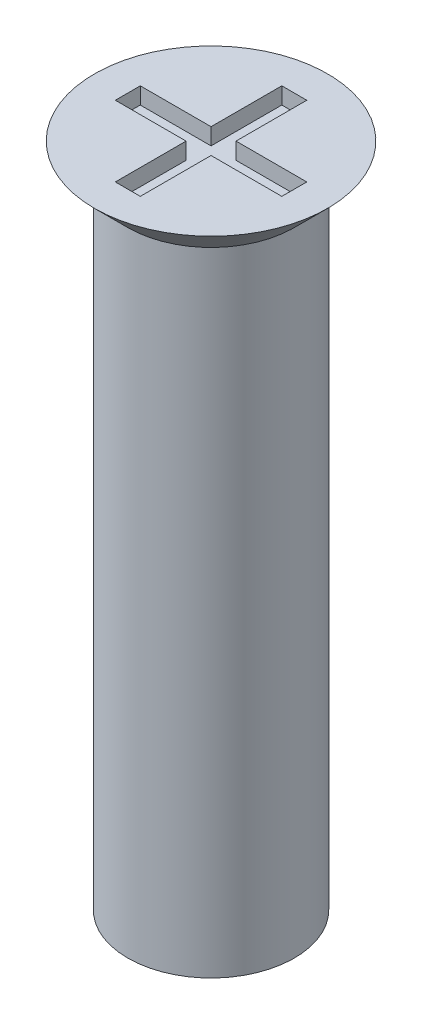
ISO-10303-21;
HEADER;
FILE_DESCRIPTION(('STEP AP214'),'2;1');
FILE_NAME('part.step','',(''),(''),'','','');
FILE_SCHEMA(('AUTOMOTIVE_DESIGN { 1 0 10303 214 1 1 1 1 }'));
ENDSEC;
DATA;
#1=APPLICATION_CONTEXT('core data for automotive mechanical design processes');
#2=APPLICATION_PROTOCOL_DEFINITION('international standard','automotive_design',2000,#1);
#3=PRODUCT_CONTEXT('',#1,'mechanical');
#4=PRODUCT('Part','Part','',(#3));
#5=PRODUCT_RELATED_PRODUCT_CATEGORY('part','',(#4));
#6=PRODUCT_DEFINITION_FORMATION('','',#4);
#7=PRODUCT_DEFINITION_CONTEXT('part definition',#1,'design');
#8=PRODUCT_DEFINITION('design','',#6,#7);
#9=PRODUCT_DEFINITION_SHAPE('','',#8);
#10=(LENGTH_UNIT() NAMED_UNIT(*) SI_UNIT(.MILLI.,.METRE.));
#11=(NAMED_UNIT(*) PLANE_ANGLE_UNIT() SI_UNIT($,.RADIAN.));
#12=(NAMED_UNIT(*) SI_UNIT($,.STERADIAN.) SOLID_ANGLE_UNIT());
#13=UNCERTAINTY_MEASURE_WITH_UNIT(LENGTH_MEASURE(1.E-05),#10,'distance_accuracy_value','');
#14=(GEOMETRIC_REPRESENTATION_CONTEXT(3) GLOBAL_UNCERTAINTY_ASSIGNED_CONTEXT((#13)) GLOBAL_UNIT_ASSIGNED_CONTEXT((#10,
#11,#12)) REPRESENTATION_CONTEXT('',''));
#15=CARTESIAN_POINT('',(0.,0.,0.));
#16=DIRECTION('',(0.,0.,1.));
#17=DIRECTION('',(1.,0.,0.));
#18=AXIS2_PLACEMENT_3D('',#15,#16,#17);
#19=CARTESIAN_POINT('',(0.,0.,0.));
#20=DIRECTION('',(0.,-1.,0.));
#21=DIRECTION('',(0.,0.,-1.));
#22=AXIS2_PLACEMENT_3D('',#19,#20,#21);
#23=PLANE('',#22);
#24=CARTESIAN_POINT('',(0.,0.,0.));
#25=DIRECTION('',(0.,1.,0.));
#26=DIRECTION('',(0.,0.,1.));
#27=AXIS2_PLACEMENT_3D('',#24,#25,#26);
#28=CIRCLE('',#27,0.5);
#29=CARTESIAN_POINT('',(0.,0.,0.5));
#30=VERTEX_POINT('',#29);
#31=EDGE_CURVE('E11',#30,#30,#28,.T.);
#32=ORIENTED_EDGE('',*,*,#31,.F.);
#33=EDGE_LOOP('',(#32));
#34=FACE_BOUND('',#33,.T.);
#35=ADVANCED_FACE('F35',(#34),#23,.T.);
#36=CARTESIAN_POINT('',(0.,2.47581230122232,0.));
#37=DIRECTION('',(0.,1.,0.));
#38=DIRECTION('',(0.,0.,1.));
#39=AXIS2_PLACEMENT_3D('',#36,#37,#38);
#40=CYLINDRICAL_SURFACE('',#39,0.5);
#41=ORIENTED_EDGE('',*,*,#31,.T.);
#42=EDGE_LOOP('',(#41));
#43=FACE_BOUND('',#42,.T.);
#44=CARTESIAN_POINT('',(0.,3.8,0.));
#45=DIRECTION('',(0.,1.,0.));
#46=DIRECTION('',(0.,0.,1.));
#47=AXIS2_PLACEMENT_3D('',#44,#45,#46);
#48=CIRCLE('',#47,0.5);
#49=CARTESIAN_POINT('',(0.,3.8,0.5));
#50=VERTEX_POINT('',#49);
#51=EDGE_CURVE('E42',#50,#50,#48,.T.);
#52=ORIENTED_EDGE('',*,*,#51,.F.);
#53=EDGE_LOOP('',(#52));
#54=FACE_BOUND('',#53,.T.);
#55=ADVANCED_FACE('F215',(#43,#54),#40,.T.);
#56=CARTESIAN_POINT('',(0.,4.,0.));
#57=DIRECTION('',(0.,1.,0.));
#58=DIRECTION('',(0.,0.,1.));
#59=AXIS2_PLACEMENT_3D('',#56,#57,#58);
#60=CONICAL_SURFACE('',#59,0.7,0.785398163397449);
#61=ORIENTED_EDGE('',*,*,#51,.T.);
#62=EDGE_LOOP('',(#61));
#63=FACE_BOUND('',#62,.T.);
#64=CARTESIAN_POINT('',(0.,4.,0.));
#65=DIRECTION('',(0.,1.,0.));
#66=DIRECTION('',(0.,0.,1.));
#67=AXIS2_PLACEMENT_3D('',#64,#65,#66);
#68=CIRCLE('',#67,0.7);
#69=CARTESIAN_POINT('',(0.,4.,0.7));
#70=VERTEX_POINT('',#69);
#71=EDGE_CURVE('E190',#70,#70,#68,.T.);
#72=ORIENTED_EDGE('',*,*,#71,.F.);
#73=EDGE_LOOP('',(#72));
#74=FACE_BOUND('',#73,.T.);
#75=ADVANCED_FACE('F212',(#63,#74),#60,.T.);
#76=CARTESIAN_POINT('',(-0.7,4.,0.));
#77=DIRECTION('',(0.,1.,0.));
#78=DIRECTION('',(0.,0.,1.));
#79=AXIS2_PLACEMENT_3D('',#76,#77,#78);
#80=PLANE('',#79);
#81=DIRECTION('',(0.,0.,1.));
#82=VECTOR('',#81,1.);
#83=CARTESIAN_POINT('',(-0.075,4.,-0.5));
#84=LINE('',#83,#82);
#85=CARTESIAN_POINT('',(-0.075,4.,-0.5));
#86=VERTEX_POINT('',#85);
#87=CARTESIAN_POINT('',(-0.075,4.,-0.075));
#88=VERTEX_POINT('',#87);
#89=EDGE_CURVE('E49',#86,#88,#84,.T.);
#90=ORIENTED_EDGE('',*,*,#89,.F.);
#91=DIRECTION('',(-1.,0.,0.));
#92=VECTOR('',#91,1.);
#93=CARTESIAN_POINT('',(-0.075,4.,-0.5));
#94=LINE('',#93,#92);
#95=CARTESIAN_POINT('',(0.075,4.,-0.5));
#96=VERTEX_POINT('',#95);
#97=EDGE_CURVE('E186',#96,#86,#94,.T.);
#98=ORIENTED_EDGE('',*,*,#97,.F.);
#99=DIRECTION('',(0.,0.,-1.));
#100=VECTOR('',#99,1.);
#101=CARTESIAN_POINT('',(0.075,4.,-0.5));
#102=LINE('',#101,#100);
#103=CARTESIAN_POINT('',(0.075,4.,-0.075));
#104=VERTEX_POINT('',#103);
#105=EDGE_CURVE('E184',#104,#96,#102,.T.);
#106=ORIENTED_EDGE('',*,*,#105,.F.);
#107=DIRECTION('',(-1.,0.,0.));
#108=VECTOR('',#107,1.);
#109=CARTESIAN_POINT('',(0.5,4.,-0.075));
#110=LINE('',#109,#108);
#111=CARTESIAN_POINT('',(0.5,4.,-0.075));
#112=VERTEX_POINT('',#111);
#113=EDGE_CURVE('E133',#112,#104,#110,.T.);
#114=ORIENTED_EDGE('',*,*,#113,.F.);
#115=DIRECTION('',(0.,0.,-1.));
#116=VECTOR('',#115,1.);
#117=CARTESIAN_POINT('',(0.5,4.,-0.075));
#118=LINE('',#117,#116);
#119=CARTESIAN_POINT('',(0.5,4.,0.075));
#120=VERTEX_POINT('',#119);
#121=EDGE_CURVE('E180',#120,#112,#118,.T.);
#122=ORIENTED_EDGE('',*,*,#121,.F.);
#123=DIRECTION('',(1.,0.,0.));
#124=VECTOR('',#123,1.);
#125=CARTESIAN_POINT('',(0.5,4.,0.075));
#126=LINE('',#125,#124);
#127=CARTESIAN_POINT('',(0.075,4.,0.075));
#128=VERTEX_POINT('',#127);
#129=EDGE_CURVE('E177',#128,#120,#126,.T.);
#130=ORIENTED_EDGE('',*,*,#129,.F.);
#131=DIRECTION('',(0.,0.,-1.));
#132=VECTOR('',#131,1.);
#133=CARTESIAN_POINT('',(0.075,4.,0.075));
#134=LINE('',#133,#132);
#135=CARTESIAN_POINT('',(0.075,4.,0.5));
#136=VERTEX_POINT('',#135);
#137=EDGE_CURVE('E174',#136,#128,#134,.T.);
#138=ORIENTED_EDGE('',*,*,#137,.F.);
#139=DIRECTION('',(1.,0.,0.));
#140=VECTOR('',#139,1.);
#141=CARTESIAN_POINT('',(-0.075,4.,0.5));
#142=LINE('',#141,#140);
#143=CARTESIAN_POINT('',(-0.075,4.,0.5));
#144=VERTEX_POINT('',#143);
#145=EDGE_CURVE('E171',#144,#136,#142,.T.);
#146=ORIENTED_EDGE('',*,*,#145,.F.);
#147=DIRECTION('',(0.,0.,1.));
#148=VECTOR('',#147,1.);
#149=CARTESIAN_POINT('',(-0.075,4.,0.075));
#150=LINE('',#149,#148);
#151=CARTESIAN_POINT('',(-0.075,4.,0.075));
#152=VERTEX_POINT('',#151);
#153=EDGE_CURVE('E168',#152,#144,#150,.T.);
#154=ORIENTED_EDGE('',*,*,#153,.F.);
#155=DIRECTION('',(1.,0.,0.));
#156=VECTOR('',#155,1.);
#157=CARTESIAN_POINT('',(-0.075,4.,0.075));
#158=LINE('',#157,#156);
#159=CARTESIAN_POINT('',(-0.5,4.,0.075));
#160=VERTEX_POINT('',#159);
#161=EDGE_CURVE('E165',#160,#152,#158,.T.);
#162=ORIENTED_EDGE('',*,*,#161,.F.);
#163=DIRECTION('',(0.,0.,1.));
#164=VECTOR('',#163,1.);
#165=CARTESIAN_POINT('',(-0.5,4.,-0.075));
#166=LINE('',#165,#164);
#167=CARTESIAN_POINT('',(-0.5,4.,-0.075));
#168=VERTEX_POINT('',#167);
#169=EDGE_CURVE('E162',#168,#160,#166,.T.);
#170=ORIENTED_EDGE('',*,*,#169,.F.);
#171=DIRECTION('',(-1.,0.,0.));
#172=VECTOR('',#171,1.);
#173=CARTESIAN_POINT('',(-0.075,4.,-0.075));
#174=LINE('',#173,#172);
#175=EDGE_CURVE('E159',#88,#168,#174,.T.);
#176=ORIENTED_EDGE('',*,*,#175,.F.);
#177=EDGE_LOOP('',(#90,#98,#106,#114,#122,#130,#138,#146,#154,#162,#170,#176));
#178=FACE_BOUND('',#177,.T.);
#179=ORIENTED_EDGE('',*,*,#71,.T.);
#180=EDGE_LOOP('',(#179));
#181=FACE_BOUND('',#180,.T.);
#182=ADVANCED_FACE('F222',(#178,#181),#80,.T.);
#183=CARTESIAN_POINT('',(-0.075,3.9,-0.5));
#184=DIRECTION('',(-1.,0.,0.));
#185=DIRECTION('',(0.,0.,1.));
#186=AXIS2_PLACEMENT_3D('',#183,#184,#185);
#187=PLANE('',#186);
#188=ORIENTED_EDGE('',*,*,#89,.T.);
#189=DIRECTION('',(0.,1.,0.));
#190=VECTOR('',#189,1.);
#191=CARTESIAN_POINT('',(-0.075,3.9,-0.075));
#192=LINE('',#191,#190);
#193=CARTESIAN_POINT('',(-0.075,3.9,-0.075));
#194=VERTEX_POINT('',#193);
#195=EDGE_CURVE('E97',#194,#88,#192,.T.);
#196=ORIENTED_EDGE('',*,*,#195,.F.);
#197=DIRECTION('',(0.,0.,1.));
#198=VECTOR('',#197,1.);
#199=CARTESIAN_POINT('',(-0.075,3.9,-0.5));
#200=LINE('',#199,#198);
#201=CARTESIAN_POINT('',(-0.075,3.9,-0.5));
#202=VERTEX_POINT('',#201);
#203=EDGE_CURVE('E188',#202,#194,#200,.T.);
#204=ORIENTED_EDGE('',*,*,#203,.F.);
#205=DIRECTION('',(0.,1.,0.));
#206=VECTOR('',#205,1.);
#207=CARTESIAN_POINT('',(-0.075,3.9,-0.5));
#208=LINE('',#207,#206);
#209=EDGE_CURVE('E57',#202,#86,#208,.T.);
#210=ORIENTED_EDGE('',*,*,#209,.T.);
#211=EDGE_LOOP('',(#188,#196,#204,#210));
#212=FACE_BOUND('',#211,.T.);
#213=ADVANCED_FACE('F228',(#212),#187,.F.);
#214=CARTESIAN_POINT('',(-0.075,3.9,-0.5));
#215=DIRECTION('',(0.,0.,-1.));
#216=DIRECTION('',(-1.,0.,0.));
#217=AXIS2_PLACEMENT_3D('',#214,#215,#216);
#218=PLANE('',#217);
#219=ORIENTED_EDGE('',*,*,#97,.T.);
#220=ORIENTED_EDGE('',*,*,#209,.F.);
#221=DIRECTION('',(-1.,0.,0.));
#222=VECTOR('',#221,1.);
#223=CARTESIAN_POINT('',(-0.075,3.9,-0.5));
#224=LINE('',#223,#222);
#225=CARTESIAN_POINT('',(0.075,3.9,-0.5));
#226=VERTEX_POINT('',#225);
#227=EDGE_CURVE('E145',#226,#202,#224,.T.);
#228=ORIENTED_EDGE('',*,*,#227,.F.);
#229=DIRECTION('',(0.,1.,0.));
#230=VECTOR('',#229,1.);
#231=CARTESIAN_POINT('',(0.075,3.9,-0.5));
#232=LINE('',#231,#230);
#233=EDGE_CURVE('E137',#226,#96,#232,.T.);
#234=ORIENTED_EDGE('',*,*,#233,.T.);
#235=EDGE_LOOP('',(#219,#220,#228,#234));
#236=FACE_BOUND('',#235,.T.);
#237=ADVANCED_FACE('F232',(#236),#218,.F.);
#238=CARTESIAN_POINT('',(0.075,3.9,-0.5));
#239=DIRECTION('',(1.,0.,0.));
#240=DIRECTION('',(0.,0.,-1.));
#241=AXIS2_PLACEMENT_3D('',#238,#239,#240);
#242=PLANE('',#241);
#243=ORIENTED_EDGE('',*,*,#105,.T.);
#244=ORIENTED_EDGE('',*,*,#233,.F.);
#245=DIRECTION('',(0.,0.,-1.));
#246=VECTOR('',#245,1.);
#247=CARTESIAN_POINT('',(0.075,3.9,-0.5));
#248=LINE('',#247,#246);
#249=CARTESIAN_POINT('',(0.075,3.9,-0.075));
#250=VERTEX_POINT('',#249);
#251=EDGE_CURVE('E141',#250,#226,#248,.T.);
#252=ORIENTED_EDGE('',*,*,#251,.F.);
#253=DIRECTION('',(0.,1.,0.));
#254=VECTOR('',#253,1.);
#255=CARTESIAN_POINT('',(0.075,3.9,-0.075));
#256=LINE('',#255,#254);
#257=EDGE_CURVE('E126',#250,#104,#256,.T.);
#258=ORIENTED_EDGE('',*,*,#257,.T.);
#259=EDGE_LOOP('',(#243,#244,#252,#258));
#260=FACE_BOUND('',#259,.T.);
#261=ADVANCED_FACE('F142',(#260),#242,.F.);
#262=CARTESIAN_POINT('',(0.5,3.9,-0.075));
#263=DIRECTION('',(0.,0.,-1.));
#264=DIRECTION('',(-1.,0.,0.));
#265=AXIS2_PLACEMENT_3D('',#262,#263,#264);
#266=PLANE('',#265);
#267=ORIENTED_EDGE('',*,*,#113,.T.);
#268=ORIENTED_EDGE('',*,*,#257,.F.);
#269=DIRECTION('',(-1.,0.,0.));
#270=VECTOR('',#269,1.);
#271=CARTESIAN_POINT('',(0.5,3.9,-0.075));
#272=LINE('',#271,#270);
#273=CARTESIAN_POINT('',(0.5,3.9,-0.075));
#274=VERTEX_POINT('',#273);
#275=EDGE_CURVE('E130',#274,#250,#272,.T.);
#276=ORIENTED_EDGE('',*,*,#275,.F.);
#277=DIRECTION('',(0.,1.,0.));
#278=VECTOR('',#277,1.);
#279=CARTESIAN_POINT('',(0.5,3.9,-0.075));
#280=LINE('',#279,#278);
#281=EDGE_CURVE('E138',#274,#112,#280,.T.);
#282=ORIENTED_EDGE('',*,*,#281,.T.);
#283=EDGE_LOOP('',(#267,#268,#276,#282));
#284=FACE_BOUND('',#283,.T.);
#285=ADVANCED_FACE('F128',(#284),#266,.F.);
#286=CARTESIAN_POINT('',(0.5,3.9,-0.075));
#287=DIRECTION('',(1.,0.,0.));
#288=DIRECTION('',(0.,0.,-1.));
#289=AXIS2_PLACEMENT_3D('',#286,#287,#288);
#290=PLANE('',#289);
#291=ORIENTED_EDGE('',*,*,#121,.T.);
#292=ORIENTED_EDGE('',*,*,#281,.F.);
#293=DIRECTION('',(0.,0.,-1.));
#294=VECTOR('',#293,1.);
#295=CARTESIAN_POINT('',(0.5,3.9,-0.075));
#296=LINE('',#295,#294);
#297=CARTESIAN_POINT('',(0.5,3.9,0.075));
#298=VERTEX_POINT('',#297);
#299=EDGE_CURVE('E151',#298,#274,#296,.T.);
#300=ORIENTED_EDGE('',*,*,#299,.F.);
#301=DIRECTION('',(0.,1.,0.));
#302=VECTOR('',#301,1.);
#303=CARTESIAN_POINT('',(0.5,3.9,0.075));
#304=LINE('',#303,#302);
#305=EDGE_CURVE('E193',#298,#120,#304,.T.);
#306=ORIENTED_EDGE('',*,*,#305,.T.);
#307=EDGE_LOOP('',(#291,#292,#300,#306));
#308=FACE_BOUND('',#307,.T.);
#309=ADVANCED_FACE('F260',(#308),#290,.F.);
#310=CARTESIAN_POINT('',(0.5,3.9,0.075));
#311=DIRECTION('',(0.,0.,1.));
#312=DIRECTION('',(1.,0.,0.));
#313=AXIS2_PLACEMENT_3D('',#310,#311,#312);
#314=PLANE('',#313);
#315=ORIENTED_EDGE('',*,*,#129,.T.);
#316=ORIENTED_EDGE('',*,*,#305,.F.);
#317=DIRECTION('',(1.,0.,0.));
#318=VECTOR('',#317,1.);
#319=CARTESIAN_POINT('',(0.5,3.9,0.075));
#320=LINE('',#319,#318);
#321=CARTESIAN_POINT('',(0.075,3.9,0.075));
#322=VERTEX_POINT('',#321);
#323=EDGE_CURVE('E153',#322,#298,#320,.T.);
#324=ORIENTED_EDGE('',*,*,#323,.F.);
#325=DIRECTION('',(0.,1.,0.));
#326=VECTOR('',#325,1.);
#327=CARTESIAN_POINT('',(0.075,3.9,0.075));
#328=LINE('',#327,#326);
#329=EDGE_CURVE('E195',#322,#128,#328,.T.);
#330=ORIENTED_EDGE('',*,*,#329,.T.);
#331=EDGE_LOOP('',(#315,#316,#324,#330));
#332=FACE_BOUND('',#331,.T.);
#333=ADVANCED_FACE('F256',(#332),#314,.F.);
#334=CARTESIAN_POINT('',(0.075,3.9,0.075));
#335=DIRECTION('',(1.,0.,0.));
#336=DIRECTION('',(0.,0.,-1.));
#337=AXIS2_PLACEMENT_3D('',#334,#335,#336);
#338=PLANE('',#337);
#339=ORIENTED_EDGE('',*,*,#137,.T.);
#340=ORIENTED_EDGE('',*,*,#329,.F.);
#341=DIRECTION('',(0.,0.,-1.));
#342=VECTOR('',#341,1.);
#343=CARTESIAN_POINT('',(0.075,3.9,0.075));
#344=LINE('',#343,#342);
#345=CARTESIAN_POINT('',(0.075,3.9,0.5));
#346=VERTEX_POINT('',#345);
#347=EDGE_CURVE('E395',#346,#322,#344,.T.);
#348=ORIENTED_EDGE('',*,*,#347,.F.);
#349=DIRECTION('',(0.,1.,0.));
#350=VECTOR('',#349,1.);
#351=CARTESIAN_POINT('',(0.075,3.9,0.5));
#352=LINE('',#351,#350);
#353=EDGE_CURVE('E197',#346,#136,#352,.T.);
#354=ORIENTED_EDGE('',*,*,#353,.T.);
#355=EDGE_LOOP('',(#339,#340,#348,#354));
#356=FACE_BOUND('',#355,.T.);
#357=ADVANCED_FACE('F252',(#356),#338,.F.);
#358=CARTESIAN_POINT('',(-0.075,3.9,0.5));
#359=DIRECTION('',(0.,0.,1.));
#360=DIRECTION('',(1.,0.,0.));
#361=AXIS2_PLACEMENT_3D('',#358,#359,#360);
#362=PLANE('',#361);
#363=ORIENTED_EDGE('',*,*,#145,.T.);
#364=ORIENTED_EDGE('',*,*,#353,.F.);
#365=DIRECTION('',(1.,0.,0.));
#366=VECTOR('',#365,1.);
#367=CARTESIAN_POINT('',(-0.075,3.9,0.5));
#368=LINE('',#367,#366);
#369=CARTESIAN_POINT('',(-0.075,3.9,0.5));
#370=VERTEX_POINT('',#369);
#371=EDGE_CURVE('E392',#370,#346,#368,.T.);
#372=ORIENTED_EDGE('',*,*,#371,.F.);
#373=DIRECTION('',(0.,1.,0.));
#374=VECTOR('',#373,1.);
#375=CARTESIAN_POINT('',(-0.075,3.9,0.5));
#376=LINE('',#375,#374);
#377=EDGE_CURVE('E199',#370,#144,#376,.T.);
#378=ORIENTED_EDGE('',*,*,#377,.T.);
#379=EDGE_LOOP('',(#363,#364,#372,#378));
#380=FACE_BOUND('',#379,.T.);
#381=ADVANCED_FACE('F248',(#380),#362,.F.);
#382=CARTESIAN_POINT('',(-0.075,3.9,0.075));
#383=DIRECTION('',(-1.,0.,0.));
#384=DIRECTION('',(0.,0.,1.));
#385=AXIS2_PLACEMENT_3D('',#382,#383,#384);
#386=PLANE('',#385);
#387=ORIENTED_EDGE('',*,*,#153,.T.);
#388=ORIENTED_EDGE('',*,*,#377,.F.);
#389=DIRECTION('',(0.,0.,1.));
#390=VECTOR('',#389,1.);
#391=CARTESIAN_POINT('',(-0.075,3.9,0.075));
#392=LINE('',#391,#390);
#393=CARTESIAN_POINT('',(-0.075,3.9,0.075));
#394=VERTEX_POINT('',#393);
#395=EDGE_CURVE('E389',#394,#370,#392,.T.);
#396=ORIENTED_EDGE('',*,*,#395,.F.);
#397=DIRECTION('',(0.,1.,0.));
#398=VECTOR('',#397,1.);
#399=CARTESIAN_POINT('',(-0.075,3.9,0.075));
#400=LINE('',#399,#398);
#401=EDGE_CURVE('E201',#394,#152,#400,.T.);
#402=ORIENTED_EDGE('',*,*,#401,.T.);
#403=EDGE_LOOP('',(#387,#388,#396,#402));
#404=FACE_BOUND('',#403,.T.);
#405=ADVANCED_FACE('F244',(#404),#386,.F.);
#406=CARTESIAN_POINT('',(-0.075,3.9,0.075));
#407=DIRECTION('',(0.,0.,1.));
#408=DIRECTION('',(1.,0.,0.));
#409=AXIS2_PLACEMENT_3D('',#406,#407,#408);
#410=PLANE('',#409);
#411=ORIENTED_EDGE('',*,*,#161,.T.);
#412=ORIENTED_EDGE('',*,*,#401,.F.);
#413=DIRECTION('',(1.,0.,0.));
#414=VECTOR('',#413,1.);
#415=CARTESIAN_POINT('',(-0.075,3.9,0.075));
#416=LINE('',#415,#414);
#417=CARTESIAN_POINT('',(-0.5,3.9,0.075));
#418=VERTEX_POINT('',#417);
#419=EDGE_CURVE('E386',#418,#394,#416,.T.);
#420=ORIENTED_EDGE('',*,*,#419,.F.);
#421=DIRECTION('',(0.,1.,0.));
#422=VECTOR('',#421,1.);
#423=CARTESIAN_POINT('',(-0.5,3.9,0.075));
#424=LINE('',#423,#422);
#425=EDGE_CURVE('E203',#418,#160,#424,.T.);
#426=ORIENTED_EDGE('',*,*,#425,.T.);
#427=EDGE_LOOP('',(#411,#412,#420,#426));
#428=FACE_BOUND('',#427,.T.);
#429=ADVANCED_FACE('F240',(#428),#410,.F.);
#430=CARTESIAN_POINT('',(-0.5,3.9,-0.075));
#431=DIRECTION('',(-1.,0.,0.));
#432=DIRECTION('',(0.,0.,1.));
#433=AXIS2_PLACEMENT_3D('',#430,#431,#432);
#434=PLANE('',#433);
#435=ORIENTED_EDGE('',*,*,#169,.T.);
#436=ORIENTED_EDGE('',*,*,#425,.F.);
#437=DIRECTION('',(0.,0.,1.));
#438=VECTOR('',#437,1.);
#439=CARTESIAN_POINT('',(-0.5,3.9,-0.075));
#440=LINE('',#439,#438);
#441=CARTESIAN_POINT('',(-0.5,3.9,-0.075));
#442=VERTEX_POINT('',#441);
#443=EDGE_CURVE('E381',#442,#418,#440,.T.);
#444=ORIENTED_EDGE('',*,*,#443,.F.);
#445=DIRECTION('',(0.,1.,0.));
#446=VECTOR('',#445,1.);
#447=CARTESIAN_POINT('',(-0.5,3.9,-0.075));
#448=LINE('',#447,#446);
#449=EDGE_CURVE('E205',#442,#168,#448,.T.);
#450=ORIENTED_EDGE('',*,*,#449,.T.);
#451=EDGE_LOOP('',(#435,#436,#444,#450));
#452=FACE_BOUND('',#451,.T.);
#453=ADVANCED_FACE('F236',(#452),#434,.F.);
#454=CARTESIAN_POINT('',(-0.075,3.9,-0.075));
#455=DIRECTION('',(0.,0.,-1.));
#456=DIRECTION('',(-1.,0.,0.));
#457=AXIS2_PLACEMENT_3D('',#454,#455,#456);
#458=PLANE('',#457);
#459=ORIENTED_EDGE('',*,*,#175,.T.);
#460=ORIENTED_EDGE('',*,*,#449,.F.);
#461=DIRECTION('',(-1.,0.,0.));
#462=VECTOR('',#461,1.);
#463=CARTESIAN_POINT('',(-0.075,3.9,-0.075));
#464=LINE('',#463,#462);
#465=EDGE_CURVE('E379',#194,#442,#464,.T.);
#466=ORIENTED_EDGE('',*,*,#465,.F.);
#467=ORIENTED_EDGE('',*,*,#195,.T.);
#468=EDGE_LOOP('',(#459,#460,#466,#467));
#469=FACE_BOUND('',#468,.T.);
#470=ADVANCED_FACE('F233',(#469),#458,.F.);
#471=CARTESIAN_POINT('',(0.,3.9,0.));
#472=DIRECTION('',(0.,-1.,0.));
#473=DIRECTION('',(0.,0.,-1.));
#474=AXIS2_PLACEMENT_3D('',#471,#472,#473);
#475=PLANE('',#474);
#476=ORIENTED_EDGE('',*,*,#203,.T.);
#477=ORIENTED_EDGE('',*,*,#465,.T.);
#478=ORIENTED_EDGE('',*,*,#443,.T.);
#479=ORIENTED_EDGE('',*,*,#419,.T.);
#480=ORIENTED_EDGE('',*,*,#395,.T.);
#481=ORIENTED_EDGE('',*,*,#371,.T.);
#482=ORIENTED_EDGE('',*,*,#347,.T.);
#483=ORIENTED_EDGE('',*,*,#323,.T.);
#484=ORIENTED_EDGE('',*,*,#299,.T.);
#485=ORIENTED_EDGE('',*,*,#275,.T.);
#486=ORIENTED_EDGE('',*,*,#251,.T.);
#487=ORIENTED_EDGE('',*,*,#227,.T.);
#488=EDGE_LOOP('',(#476,#477,#478,#479,#480,#481,#482,#483,#484,#485,#486,#487));
#489=FACE_BOUND('',#488,.T.);
#490=ADVANCED_FACE('F148',(#489),#475,.F.);
#491=CLOSED_SHELL('',(#35,#55,#75,#182,#213,#237,#261,#285,#309,#333,#357,#381,#405,#429,#453,
#470,#490));
#492=MANIFOLD_SOLID_BREP('B2',#491);
#493=ADVANCED_BREP_SHAPE_REPRESENTATION('',(#18,#492),#14);
#494=SHAPE_DEFINITION_REPRESENTATION(#9,#493);
ENDSEC;
END-ISO-10303-21;
